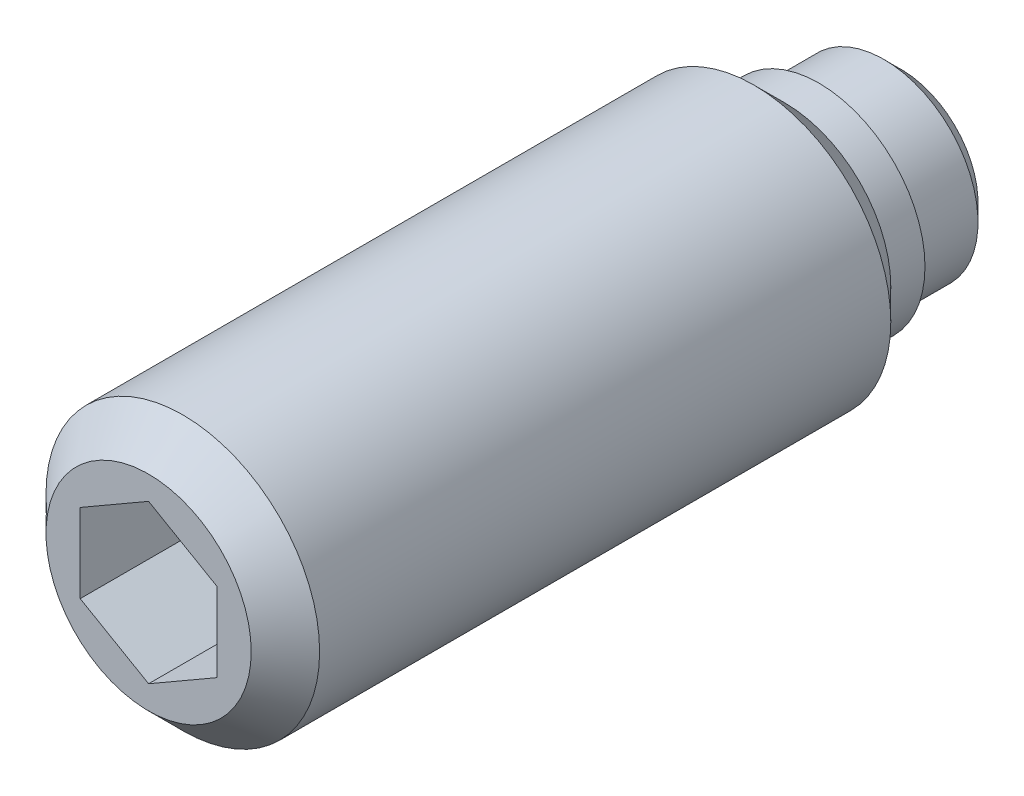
ISO-10303-21;
HEADER;
FILE_DESCRIPTION(('STEP AP214'),'2;1');
FILE_NAME('part.step','',(''),(''),'','','');
FILE_SCHEMA(('AUTOMOTIVE_DESIGN { 1 0 10303 214 1 1 1 1 }'));
ENDSEC;
DATA;
#1=APPLICATION_CONTEXT('core data for automotive mechanical design processes');
#2=APPLICATION_PROTOCOL_DEFINITION('international standard','automotive_design',2000,#1);
#3=PRODUCT_CONTEXT('',#1,'mechanical');
#4=PRODUCT('Part','Part','',(#3));
#5=PRODUCT_RELATED_PRODUCT_CATEGORY('part','',(#4));
#6=PRODUCT_DEFINITION_FORMATION('','',#4);
#7=PRODUCT_DEFINITION_CONTEXT('part definition',#1,'design');
#8=PRODUCT_DEFINITION('design','',#6,#7);
#9=PRODUCT_DEFINITION_SHAPE('','',#8);
#10=(LENGTH_UNIT() NAMED_UNIT(*) SI_UNIT(.MILLI.,.METRE.));
#11=(NAMED_UNIT(*) PLANE_ANGLE_UNIT() SI_UNIT($,.RADIAN.));
#12=(NAMED_UNIT(*) SI_UNIT($,.STERADIAN.) SOLID_ANGLE_UNIT());
#13=UNCERTAINTY_MEASURE_WITH_UNIT(LENGTH_MEASURE(1.E-05),#10,'distance_accuracy_value','');
#14=(GEOMETRIC_REPRESENTATION_CONTEXT(3) GLOBAL_UNCERTAINTY_ASSIGNED_CONTEXT((#13)) GLOBAL_UNIT_ASSIGNED_CONTEXT((#10,
#11,#12)) REPRESENTATION_CONTEXT('',''));
#15=CARTESIAN_POINT('',(0.,0.,0.));
#16=DIRECTION('',(0.,0.,1.));
#17=DIRECTION('',(1.,0.,0.));
#18=AXIS2_PLACEMENT_3D('',#15,#16,#17);
#19=CARTESIAN_POINT('',(0.,0.,2.4));
#20=DIRECTION('',(0.,0.,-1.));
#21=DIRECTION('',(-1.,0.,0.));
#22=AXIS2_PLACEMENT_3D('',#19,#20,#21);
#23=CYLINDRICAL_SURFACE('',#22,4.);
#24=CARTESIAN_POINT('',(0.,0.,4.3));
#25=DIRECTION('',(0.,0.,-1.));
#26=DIRECTION('',(-1.,0.,0.));
#27=AXIS2_PLACEMENT_3D('',#24,#25,#26);
#28=CIRCLE('',#27,4.);
#29=CARTESIAN_POINT('',(-4.,0.,4.3));
#30=VERTEX_POINT('',#29);
#31=EDGE_CURVE('E9',#30,#30,#28,.T.);
#32=ORIENTED_EDGE('',*,*,#31,.F.);
#33=EDGE_LOOP('',(#32));
#34=FACE_BOUND('',#33,.T.);
#35=CARTESIAN_POINT('',(0.,0.,21.));
#36=DIRECTION('',(0.,0.,1.));
#37=DIRECTION('',(1.,0.,0.));
#38=AXIS2_PLACEMENT_3D('',#35,#36,#37);
#39=CIRCLE('',#38,4.);
#40=CARTESIAN_POINT('',(4.,0.,21.));
#41=VERTEX_POINT('',#40);
#42=EDGE_CURVE('E70',#41,#41,#39,.T.);
#43=ORIENTED_EDGE('',*,*,#42,.F.);
#44=EDGE_LOOP('',(#43));
#45=FACE_BOUND('',#44,.T.);
#46=ADVANCED_FACE('F14',(#34,#45),#23,.T.);
#47=CARTESIAN_POINT('',(0.,0.,4.3));
#48=DIRECTION('',(0.,0.,1.));
#49=DIRECTION('',(1.,0.,0.));
#50=AXIS2_PLACEMENT_3D('',#47,#48,#49);
#51=CONICAL_SURFACE('',#50,4.,0.785398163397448);
#52=ORIENTED_EDGE('',*,*,#31,.T.);
#53=EDGE_LOOP('',(#52));
#54=FACE_BOUND('',#53,.T.);
#55=CARTESIAN_POINT('',(0.,0.,3.4));
#56=DIRECTION('',(0.,0.,-1.));
#57=DIRECTION('',(-1.,0.,0.));
#58=AXIS2_PLACEMENT_3D('',#55,#56,#57);
#59=CIRCLE('',#58,3.1);
#60=CARTESIAN_POINT('',(-3.1,0.,3.4));
#61=VERTEX_POINT('',#60);
#62=EDGE_CURVE('E21',#61,#61,#59,.T.);
#63=ORIENTED_EDGE('',*,*,#62,.F.);
#64=EDGE_LOOP('',(#63));
#65=FACE_BOUND('',#64,.T.);
#66=ADVANCED_FACE('F139',(#54,#65),#51,.T.);
#67=CARTESIAN_POINT('',(0.,0.,2.4));
#68=DIRECTION('',(0.,0.,-1.));
#69=DIRECTION('',(-1.,0.,0.));
#70=AXIS2_PLACEMENT_3D('',#67,#68,#69);
#71=CYLINDRICAL_SURFACE('',#70,3.1);
#72=ORIENTED_EDGE('',*,*,#62,.T.);
#73=EDGE_LOOP('',(#72));
#74=FACE_BOUND('',#73,.T.);
#75=CARTESIAN_POINT('',(0.,0.,2.4));
#76=DIRECTION('',(0.,0.,-1.));
#77=DIRECTION('',(-1.,0.,0.));
#78=AXIS2_PLACEMENT_3D('',#75,#76,#77);
#79=CIRCLE('',#78,3.1);
#80=CARTESIAN_POINT('',(-3.1,0.,2.4));
#81=VERTEX_POINT('',#80);
#82=EDGE_CURVE('E131',#81,#81,#79,.T.);
#83=ORIENTED_EDGE('',*,*,#82,.F.);
#84=EDGE_LOOP('',(#83));
#85=FACE_BOUND('',#84,.T.);
#86=ADVANCED_FACE('F136',(#74,#85),#71,.T.);
#87=CARTESIAN_POINT('',(0.,3.1,2.4));
#88=DIRECTION('',(0.,0.,1.));
#89=DIRECTION('',(1.,0.,0.));
#90=AXIS2_PLACEMENT_3D('',#87,#88,#89);
#91=PLANE('',#90);
#92=ORIENTED_EDGE('',*,*,#82,.T.);
#93=EDGE_LOOP('',(#92));
#94=FACE_BOUND('',#93,.T.);
#95=CARTESIAN_POINT('',(0.,0.,2.4));
#96=DIRECTION('',(0.,0.,-1.));
#97=DIRECTION('',(-1.,0.,0.));
#98=AXIS2_PLACEMENT_3D('',#95,#96,#97);
#99=CIRCLE('',#98,2.75);
#100=CARTESIAN_POINT('',(-2.75,0.,2.4));
#101=VERTEX_POINT('',#100);
#102=EDGE_CURVE('E128',#101,#101,#99,.T.);
#103=ORIENTED_EDGE('',*,*,#102,.F.);
#104=EDGE_LOOP('',(#103));
#105=FACE_BOUND('',#104,.T.);
#106=ADVANCED_FACE('F147',(#94,#105),#91,.F.);
#107=CARTESIAN_POINT('',(0.,0.,0.));
#108=DIRECTION('',(0.,0.,-1.));
#109=DIRECTION('',(-1.,0.,0.));
#110=AXIS2_PLACEMENT_3D('',#107,#108,#109);
#111=CYLINDRICAL_SURFACE('',#110,2.75);
#112=CARTESIAN_POINT('',(0.,0.,0.5));
#113=DIRECTION('',(0.,0.,-1.));
#114=DIRECTION('',(-1.,0.,0.));
#115=AXIS2_PLACEMENT_3D('',#112,#113,#114);
#116=CIRCLE('',#115,2.75);
#117=CARTESIAN_POINT('',(-2.75,0.,0.5));
#118=VERTEX_POINT('',#117);
#119=EDGE_CURVE('E125',#118,#118,#116,.T.);
#120=ORIENTED_EDGE('',*,*,#119,.F.);
#121=EDGE_LOOP('',(#120));
#122=FACE_BOUND('',#121,.T.);
#123=ORIENTED_EDGE('',*,*,#102,.T.);
#124=EDGE_LOOP('',(#123));
#125=FACE_BOUND('',#124,.T.);
#126=ADVANCED_FACE('F153',(#122,#125),#111,.T.);
#127=CARTESIAN_POINT('',(0.,0.,0.5));
#128=DIRECTION('',(0.,0.,1.));
#129=DIRECTION('',(1.,0.,0.));
#130=AXIS2_PLACEMENT_3D('',#127,#128,#129);
#131=CONICAL_SURFACE('',#130,2.75,0.785398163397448);
#132=CARTESIAN_POINT('',(0.,0.,0.));
#133=DIRECTION('',(0.,0.,-1.));
#134=DIRECTION('',(-1.,0.,0.));
#135=AXIS2_PLACEMENT_3D('',#132,#133,#134);
#136=CIRCLE('',#135,2.25);
#137=CARTESIAN_POINT('',(-2.25,0.,0.));
#138=VERTEX_POINT('',#137);
#139=EDGE_CURVE('E122',#138,#138,#136,.T.);
#140=ORIENTED_EDGE('',*,*,#139,.F.);
#141=EDGE_LOOP('',(#140));
#142=FACE_BOUND('',#141,.T.);
#143=ORIENTED_EDGE('',*,*,#119,.T.);
#144=EDGE_LOOP('',(#143));
#145=FACE_BOUND('',#144,.T.);
#146=ADVANCED_FACE('F157',(#142,#145),#131,.T.);
#147=CARTESIAN_POINT('',(0.,2.25,0.));
#148=DIRECTION('',(0.,0.,1.));
#149=DIRECTION('',(1.,0.,0.));
#150=AXIS2_PLACEMENT_3D('',#147,#148,#149);
#151=PLANE('',#150);
#152=ORIENTED_EDGE('',*,*,#139,.T.);
#153=EDGE_LOOP('',(#152));
#154=FACE_BOUND('',#153,.T.);
#155=ADVANCED_FACE('F161',(#154),#151,.F.);
#156=CARTESIAN_POINT('',(0.,0.,22.));
#157=DIRECTION('',(0.,0.,1.));
#158=DIRECTION('',(1.,0.,0.));
#159=AXIS2_PLACEMENT_3D('',#156,#157,#158);
#160=PLANE('',#159);
#161=DIRECTION('',(0.866025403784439,-0.5,0.));
#162=VECTOR('',#161,1.);
#163=CARTESIAN_POINT('',(-2.,-1.15470053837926,22.));
#164=LINE('',#163,#162);
#165=CARTESIAN_POINT('',(-2.,-1.15470053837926,22.));
#166=VERTEX_POINT('',#165);
#167=CARTESIAN_POINT('',(0.,-2.30940107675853,22.));
#168=VERTEX_POINT('',#167);
#169=EDGE_CURVE('E28',#166,#168,#164,.T.);
#170=ORIENTED_EDGE('',*,*,#169,.F.);
#171=DIRECTION('',(0.,-1.,0.));
#172=VECTOR('',#171,1.);
#173=CARTESIAN_POINT('',(-2.,1.15470053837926,22.));
#174=LINE('',#173,#172);
#175=CARTESIAN_POINT('',(-2.,1.15470053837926,22.));
#176=VERTEX_POINT('',#175);
#177=EDGE_CURVE('E69',#176,#166,#174,.T.);
#178=ORIENTED_EDGE('',*,*,#177,.F.);
#179=DIRECTION('',(-0.866025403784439,-0.5,0.));
#180=VECTOR('',#179,1.);
#181=CARTESIAN_POINT('',(0.,2.30940107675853,22.));
#182=LINE('',#181,#180);
#183=CARTESIAN_POINT('',(0.,2.30940107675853,22.));
#184=VERTEX_POINT('',#183);
#185=EDGE_CURVE('E105',#184,#176,#182,.T.);
#186=ORIENTED_EDGE('',*,*,#185,.F.);
#187=DIRECTION('',(-0.866025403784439,0.5,0.));
#188=VECTOR('',#187,1.);
#189=CARTESIAN_POINT('',(2.,1.15470053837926,22.));
#190=LINE('',#189,#188);
#191=CARTESIAN_POINT('',(2.,1.15470053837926,22.));
#192=VERTEX_POINT('',#191);
#193=EDGE_CURVE('E102',#192,#184,#190,.T.);
#194=ORIENTED_EDGE('',*,*,#193,.F.);
#195=DIRECTION('',(0.,1.,0.));
#196=VECTOR('',#195,1.);
#197=CARTESIAN_POINT('',(2.,-1.15470053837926,22.));
#198=LINE('',#197,#196);
#199=CARTESIAN_POINT('',(2.,-1.15470053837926,22.));
#200=VERTEX_POINT('',#199);
#201=EDGE_CURVE('E99',#200,#192,#198,.T.);
#202=ORIENTED_EDGE('',*,*,#201,.F.);
#203=DIRECTION('',(0.866025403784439,0.5,0.));
#204=VECTOR('',#203,1.);
#205=CARTESIAN_POINT('',(0.,-2.30940107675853,22.));
#206=LINE('',#205,#204);
#207=EDGE_CURVE('E96',#168,#200,#206,.T.);
#208=ORIENTED_EDGE('',*,*,#207,.F.);
#209=EDGE_LOOP('',(#170,#178,#186,#194,#202,#208));
#210=FACE_BOUND('',#209,.T.);
#211=CARTESIAN_POINT('',(0.,0.,22.));
#212=DIRECTION('',(0.,0.,1.));
#213=DIRECTION('',(1.,0.,0.));
#214=AXIS2_PLACEMENT_3D('',#211,#212,#213);
#215=CIRCLE('',#214,3.);
#216=CARTESIAN_POINT('',(3.,0.,22.));
#217=VERTEX_POINT('',#216);
#218=EDGE_CURVE('E119',#217,#217,#215,.T.);
#219=ORIENTED_EDGE('',*,*,#218,.T.);
#220=EDGE_LOOP('',(#219));
#221=FACE_BOUND('',#220,.T.);
#222=ADVANCED_FACE('F165',(#210,#221),#160,.T.);
#223=CARTESIAN_POINT('',(0.,0.,22.));
#224=DIRECTION('',(0.,0.,-1.));
#225=DIRECTION('',(-1.,0.,0.));
#226=AXIS2_PLACEMENT_3D('',#223,#224,#225);
#227=CONICAL_SURFACE('',#226,3.,0.785398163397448);
#228=ORIENTED_EDGE('',*,*,#42,.T.);
#229=EDGE_LOOP('',(#228));
#230=FACE_BOUND('',#229,.T.);
#231=ORIENTED_EDGE('',*,*,#218,.F.);
#232=EDGE_LOOP('',(#231));
#233=FACE_BOUND('',#232,.T.);
#234=ADVANCED_FACE('F169',(#230,#233),#227,.T.);
#235=CARTESIAN_POINT('',(-2.,-1.15470053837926,19.));
#236=DIRECTION('',(-0.5,-0.866025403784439,0.));
#237=DIRECTION('',(0.866025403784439,-0.5,0.));
#238=AXIS2_PLACEMENT_3D('',#235,#236,#237);
#239=PLANE('',#238);
#240=ORIENTED_EDGE('',*,*,#169,.T.);
#241=DIRECTION('',(0.,0.,1.));
#242=VECTOR('',#241,1.);
#243=CARTESIAN_POINT('',(0.,-2.30940107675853,19.));
#244=LINE('',#243,#242);
#245=CARTESIAN_POINT('',(0.,-2.30940107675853,17.));
#246=VERTEX_POINT('',#245);
#247=EDGE_CURVE('E76',#246,#168,#244,.T.);
#248=ORIENTED_EDGE('',*,*,#247,.F.);
#249=DIRECTION('',(0.866025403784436,-0.5,0.));
#250=VECTOR('',#249,1.);
#251=CARTESIAN_POINT('',(-2.,-1.15470053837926,17.));
#252=LINE('',#251,#250);
#253=CARTESIAN_POINT('',(-2.,-1.15470053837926,17.));
#254=VERTEX_POINT('',#253);
#255=EDGE_CURVE('E74',#254,#246,#252,.T.);
#256=ORIENTED_EDGE('',*,*,#255,.F.);
#257=DIRECTION('',(0.,0.,1.));
#258=VECTOR('',#257,1.);
#259=CARTESIAN_POINT('',(-2.,-1.15470053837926,19.));
#260=LINE('',#259,#258);
#261=EDGE_CURVE('E33',#254,#166,#260,.T.);
#262=ORIENTED_EDGE('',*,*,#261,.T.);
#263=EDGE_LOOP('',(#240,#248,#256,#262));
#264=FACE_BOUND('',#263,.T.);
#265=ADVANCED_FACE('F75',(#264),#239,.F.);
#266=CARTESIAN_POINT('',(-2.,1.15470053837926,19.));
#267=DIRECTION('',(-1.,0.,0.));
#268=DIRECTION('',(0.,0.,1.));
#269=AXIS2_PLACEMENT_3D('',#266,#267,#268);
#270=PLANE('',#269);
#271=ORIENTED_EDGE('',*,*,#177,.T.);
#272=ORIENTED_EDGE('',*,*,#261,.F.);
#273=DIRECTION('',(0.,-1.,0.));
#274=VECTOR('',#273,1.);
#275=CARTESIAN_POINT('',(-2.,1.15470053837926,17.));
#276=LINE('',#275,#274);
#277=CARTESIAN_POINT('',(-2.,1.15470053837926,17.));
#278=VERTEX_POINT('',#277);
#279=EDGE_CURVE('E66',#278,#254,#276,.T.);
#280=ORIENTED_EDGE('',*,*,#279,.F.);
#281=DIRECTION('',(0.,0.,1.));
#282=VECTOR('',#281,1.);
#283=CARTESIAN_POINT('',(-2.,1.15470053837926,19.));
#284=LINE('',#283,#282);
#285=EDGE_CURVE('E71',#278,#176,#284,.T.);
#286=ORIENTED_EDGE('',*,*,#285,.T.);
#287=EDGE_LOOP('',(#271,#272,#280,#286));
#288=FACE_BOUND('',#287,.T.);
#289=ADVANCED_FACE('F64',(#288),#270,.F.);
#290=CARTESIAN_POINT('',(0.,2.30940107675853,19.));
#291=DIRECTION('',(-0.5,0.866025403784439,0.));
#292=DIRECTION('',(-0.866025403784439,-0.5,0.));
#293=AXIS2_PLACEMENT_3D('',#290,#291,#292);
#294=PLANE('',#293);
#295=ORIENTED_EDGE('',*,*,#185,.T.);
#296=ORIENTED_EDGE('',*,*,#285,.F.);
#297=DIRECTION('',(-0.866025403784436,-0.5,0.));
#298=VECTOR('',#297,1.);
#299=CARTESIAN_POINT('',(0.,2.30940107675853,17.));
#300=LINE('',#299,#298);
#301=CARTESIAN_POINT('',(0.,2.30940107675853,17.));
#302=VERTEX_POINT('',#301);
#303=EDGE_CURVE('E85',#302,#278,#300,.T.);
#304=ORIENTED_EDGE('',*,*,#303,.F.);
#305=DIRECTION('',(0.,0.,1.));
#306=VECTOR('',#305,1.);
#307=CARTESIAN_POINT('',(0.,2.30940107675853,19.));
#308=LINE('',#307,#306);
#309=EDGE_CURVE('E110',#302,#184,#308,.T.);
#310=ORIENTED_EDGE('',*,*,#309,.T.);
#311=EDGE_LOOP('',(#295,#296,#304,#310));
#312=FACE_BOUND('',#311,.T.);
#313=ADVANCED_FACE('F187',(#312),#294,.F.);
#314=CARTESIAN_POINT('',(2.,1.15470053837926,19.));
#315=DIRECTION('',(0.5,0.866025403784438,0.));
#316=DIRECTION('',(-0.866025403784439,0.5,0.));
#317=AXIS2_PLACEMENT_3D('',#314,#315,#316);
#318=PLANE('',#317);
#319=ORIENTED_EDGE('',*,*,#193,.T.);
#320=ORIENTED_EDGE('',*,*,#309,.F.);
#321=DIRECTION('',(-0.866025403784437,0.5,0.));
#322=VECTOR('',#321,1.);
#323=CARTESIAN_POINT('',(2.,1.15470053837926,17.));
#324=LINE('',#323,#322);
#325=CARTESIAN_POINT('',(2.,1.15470053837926,17.));
#326=VERTEX_POINT('',#325);
#327=EDGE_CURVE('E92',#326,#302,#324,.T.);
#328=ORIENTED_EDGE('',*,*,#327,.F.);
#329=DIRECTION('',(0.,0.,1.));
#330=VECTOR('',#329,1.);
#331=CARTESIAN_POINT('',(2.,1.15470053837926,19.));
#332=LINE('',#331,#330);
#333=EDGE_CURVE('E112',#326,#192,#332,.T.);
#334=ORIENTED_EDGE('',*,*,#333,.T.);
#335=EDGE_LOOP('',(#319,#320,#328,#334));
#336=FACE_BOUND('',#335,.T.);
#337=ADVANCED_FACE('F183',(#336),#318,.F.);
#338=CARTESIAN_POINT('',(2.,-1.15470053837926,19.));
#339=DIRECTION('',(1.,0.,0.));
#340=DIRECTION('',(0.,0.,-1.));
#341=AXIS2_PLACEMENT_3D('',#338,#339,#340);
#342=PLANE('',#341);
#343=ORIENTED_EDGE('',*,*,#201,.T.);
#344=ORIENTED_EDGE('',*,*,#333,.F.);
#345=DIRECTION('',(0.,1.,0.));
#346=VECTOR('',#345,1.);
#347=CARTESIAN_POINT('',(2.,-1.15470053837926,17.));
#348=LINE('',#347,#346);
#349=CARTESIAN_POINT('',(2.,-1.15470053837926,17.));
#350=VERTEX_POINT('',#349);
#351=EDGE_CURVE('E89',#350,#326,#348,.T.);
#352=ORIENTED_EDGE('',*,*,#351,.F.);
#353=DIRECTION('',(0.,0.,1.));
#354=VECTOR('',#353,1.);
#355=CARTESIAN_POINT('',(2.,-1.15470053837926,19.));
#356=LINE('',#355,#354);
#357=EDGE_CURVE('E114',#350,#200,#356,.T.);
#358=ORIENTED_EDGE('',*,*,#357,.T.);
#359=EDGE_LOOP('',(#343,#344,#352,#358));
#360=FACE_BOUND('',#359,.T.);
#361=ADVANCED_FACE('F179',(#360),#342,.F.);
#362=CARTESIAN_POINT('',(0.,-2.30940107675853,19.));
#363=DIRECTION('',(0.5,-0.866025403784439,0.));
#364=DIRECTION('',(0.866025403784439,0.5,0.));
#365=AXIS2_PLACEMENT_3D('',#362,#363,#364);
#366=PLANE('',#365);
#367=ORIENTED_EDGE('',*,*,#207,.T.);
#368=ORIENTED_EDGE('',*,*,#357,.F.);
#369=DIRECTION('',(0.866025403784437,0.5,0.));
#370=VECTOR('',#369,1.);
#371=CARTESIAN_POINT('',(0.,-2.30940107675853,17.));
#372=LINE('',#371,#370);
#373=EDGE_CURVE('E80',#246,#350,#372,.T.);
#374=ORIENTED_EDGE('',*,*,#373,.F.);
#375=ORIENTED_EDGE('',*,*,#247,.T.);
#376=EDGE_LOOP('',(#367,#368,#374,#375));
#377=FACE_BOUND('',#376,.T.);
#378=ADVANCED_FACE('F176',(#377),#366,.F.);
#379=CARTESIAN_POINT('',(0.,0.,17.));
#380=DIRECTION('',(0.,0.,1.));
#381=DIRECTION('',(1.,0.,0.));
#382=AXIS2_PLACEMENT_3D('',#379,#380,#381);
#383=PLANE('',#382);
#384=ORIENTED_EDGE('',*,*,#279,.T.);
#385=ORIENTED_EDGE('',*,*,#255,.T.);
#386=ORIENTED_EDGE('',*,*,#373,.T.);
#387=ORIENTED_EDGE('',*,*,#351,.T.);
#388=ORIENTED_EDGE('',*,*,#327,.T.);
#389=ORIENTED_EDGE('',*,*,#303,.T.);
#390=EDGE_LOOP('',(#384,#385,#386,#387,#388,#389));
#391=FACE_BOUND('',#390,.T.);
#392=ADVANCED_FACE('F82',(#391),#383,.T.);
#393=CLOSED_SHELL('',(#46,#66,#86,#106,#126,#146,#155,#222,#234,#265,#289,#313,#337,#361,#378,#392));
#394=MANIFOLD_SOLID_BREP('B1',#393);
#395=ADVANCED_BREP_SHAPE_REPRESENTATION('',(#18,#394),#14);
#396=SHAPE_DEFINITION_REPRESENTATION(#9,#395);
ENDSEC;
END-ISO-10303-21;
